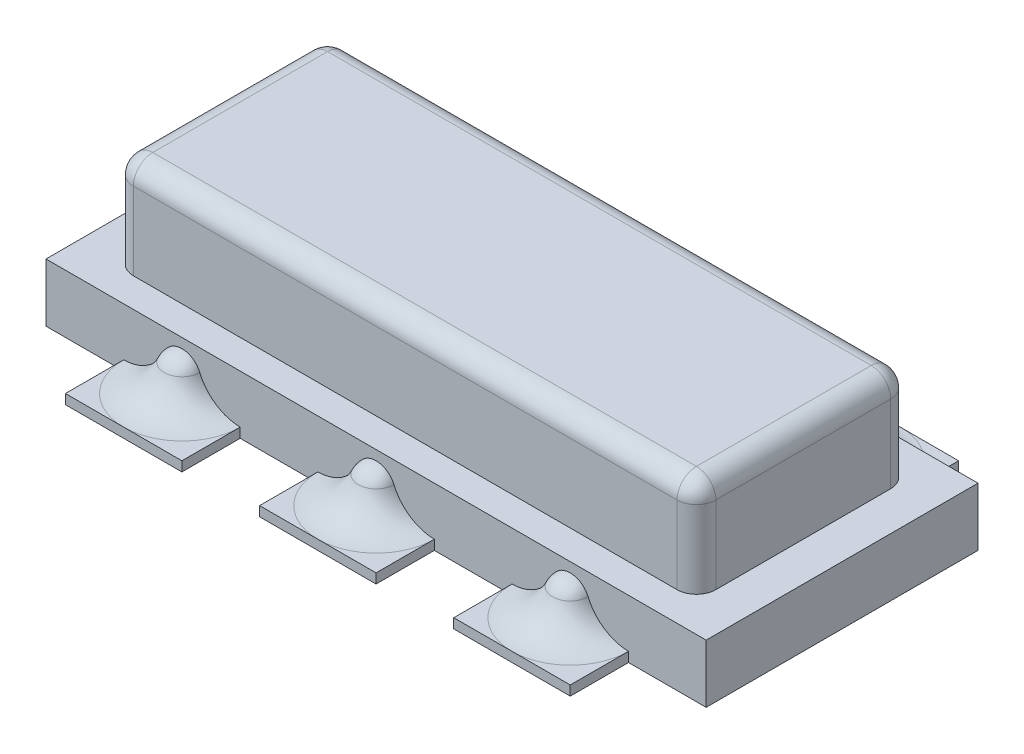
from build123d import *

# Parameters (mm, degrees)
SKETCH1_W            = 3.4
SKETCH1_H            = 1.4
BOSS_EXTRUDE1_DEPTH  = 0.3
BOSS_EXTRUDE2_DEPTH  = 0.5
FILLET1_R            = 0.1
SKETCH3_W            = 0.6
SKETCH3_H            = 2
BOSS_EXTRUDE3_DEPTH  = 0.05
LPATTERN1_COUNT      = 3
LPATTERN1_PITCH      = 1
LPATTERN1_COUNT_DIR2 = 2
LPATTERN1_PITCH_DIR2 = 1.4


with BuildPart() as part:
    # Sketch1 → Boss-Extrude1 (new body)
    with BuildSketch(Plane(origin=(0, 0, 0), x_dir=(1, 0, 0), z_dir=(0, 1, 0))):
        Rectangle(SKETCH1_W, SKETCH1_H)
    extrude(amount=BOSS_EXTRUDE1_DEPTH)

    # Sketch2 → Boss-Extrude2 (add)
    with BuildSketch(Plane(origin=(0, 0.3, 0), x_dir=(1, 0, 0), z_dir=(0, 1, 0))):
        with BuildLine():
            Line((-1.4, 0.55), (1.4, 0.55))
            ThreePointArc((1.4, 0.55), (1.470710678, 0.520710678), (1.5, 0.45))
            Line((1.5, 0.45), (1.5, -0.45))
            ThreePointArc((1.5, -0.45), (1.470710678, -0.520710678), (1.4, -0.55))
            Line((1.4, -0.55), (-1.4, -0.55))
            ThreePointArc((-1.4, -0.55), (-1.470710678, -0.520710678), (-1.5, -0.45))
            Line((-1.5, -0.45), (-1.5, 0.45))
            ThreePointArc((-1.5, 0.45), (-1.470710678, 0.520710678), (-1.4, 0.55))
        make_face()
    extrude(amount=BOSS_EXTRUDE2_DEPTH)

    # Fillet1
    fillet1_edges = [part.edges().sort_by_distance(p)[0] for p in [
        (-1.470710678, 0.8, 0.520710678),
        (0, 0.8, 0.55),
        (1.470710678, 0.8, 0.520710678),
        (1.5, 0.8, 0),
        (1.470710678, 0.8, -0.520710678),
        (0, 0.8, -0.55),
        (-1.470710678, 0.8, -0.520710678),
        (-1.5, 0.8, 0),
    ]]
    fillet(fillet1_edges, radius=FILLET1_R)

    # Sketch3 → Boss-Extrude3 (add)
    with BuildSketch(Plane(origin=(0, 0, 0), x_dir=(1, 0, 0), z_dir=(0, 1, 0))):
        with Locations((-1, 0)):
            Rectangle(SKETCH3_W, SKETCH3_H)
        Rectangle(SKETCH3_W, SKETCH3_H)
        with Locations((1, 0)):
            Rectangle(SKETCH3_W, SKETCH3_H)
    extrude(amount=BOSS_EXTRUDE3_DEPTH)

    # Sketch4 → Revolve2 (revolve)
    with BuildSketch(Plane(origin=(-1, 0, 0), x_dir=(0, 0, -1), z_dir=(1, 0, 0))):
        with BuildLine():
            Line((0.7, 0.25), (0.7, 0.05))
            Line((0.7, 0.05), (1, 0.05))
            ThreePointArc((1, 0.05), (0.87532212, 0.088886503), (0.791916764, 0.189386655))
            ThreePointArc((0.791916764, 0.189386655), (0.755051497, 0.233482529), (0.7, 0.25))
        make_face()
    revolve2 = revolve(axis=Axis((-1, 0.3, -0.7), (0, -1, 0)))

    # LPattern1: Revolve2 3 × 2
    with Locations(*[(i * LPATTERN1_PITCH, 0, j * LPATTERN1_PITCH_DIR2) for i in range(LPATTERN1_COUNT) for j in range(LPATTERN1_COUNT_DIR2) if (i, j) != (0, 0)]):
        add(revolve2)


solid = part.part
